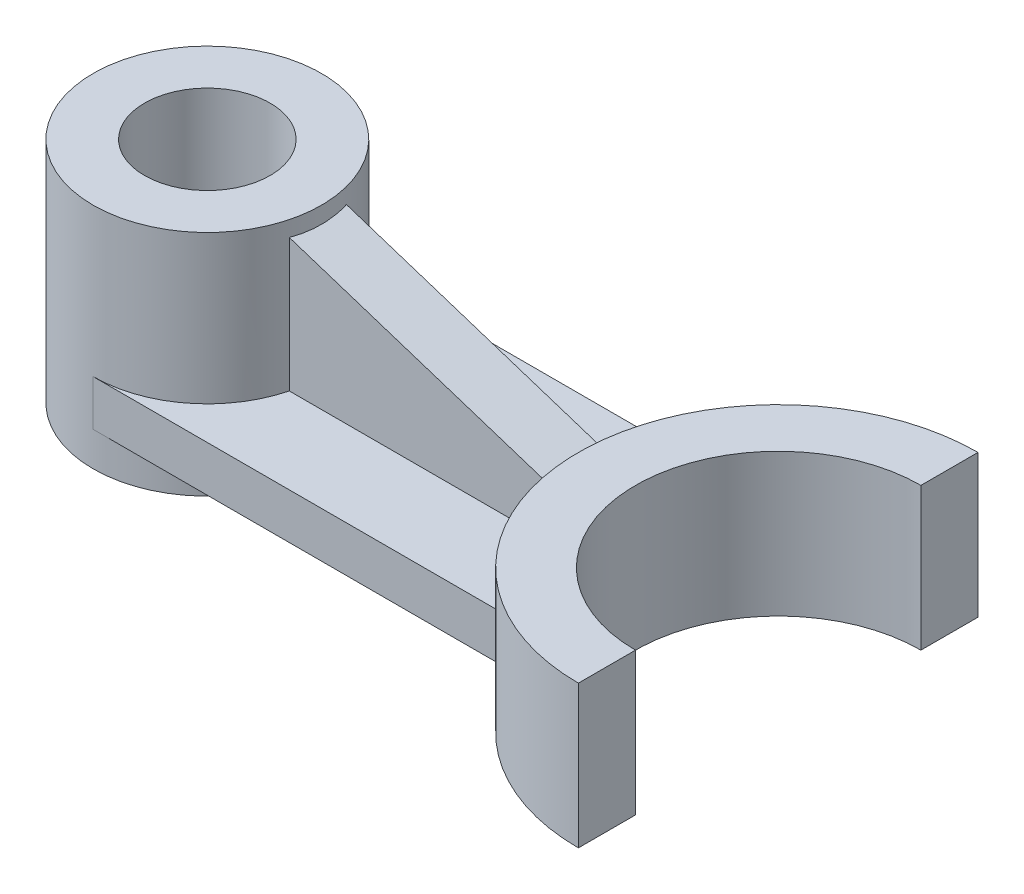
from build123d import *

# Parameters (mm, degrees)
SKETCH_1_R      = 20
SKETCH_1_R_2    = 11
EXTRUDE_1_DEPTH = 40
EXTRUDE_2_DEPTH = 25
EXTRUDE_3_DEPTH = 4
RIB_1_REACH     = 115.248
SKETCH_3_WALL_W = 276.324589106
SKETCH_3_WALL_H = 10


with BuildPart() as part:
    # Sketch 1 → Extrude 1 (new body)
    with BuildSketch(Plane(origin=(0, 0, 0), x_dir=(1, 0, 0), z_dir=(0, 1, 0))):
        with Locations(Location((0, 0, 0), (0, 0, 270))):
            Circle(SKETCH_1_R)
        with Locations(Location((0, 0, 0), (0, 0, 270))):
            Circle(SKETCH_1_R_2, mode=Mode.SUBTRACT)
    extrude(amount=EXTRUDE_1_DEPTH)



with BuildPart() as body_2:
    # Sketch 1_3 → Extrude 2 (new body)
    with BuildSketch(Plane(origin=(0, 0, 0), x_dir=(1, 0, 0), z_dir=(0, 1, 0))):
        with BuildLine():
            Line((100, 35), (100, 25))
            ThreePointArc((100, 25), (75, 0), (100, -25))
            Line((100, -25), (100, -35))
            ThreePointArc((100, -35), (65, 0), (100, 35))
        make_face()
    extrude(amount=EXTRUDE_2_DEPTH)


with BuildPart() as part_1:
    add(part.part)

    add(body_2.part)  # Extrude 3 merges body 2
    # Sketch 2 → Extrude 3 (add, symmetric)
    with BuildSketch(Plane(origin=(0, 10, 0), x_dir=(-1, 0, 0), z_dir=(0, 1, 0))):
        with BuildLine():
            Line((0, 20), (-71.277186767, 20))
            ThreePointArc((-71.277186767, 20), (-65, 0), (-71.277186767, -20))
            Line((-71.277186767, -20), (0, -20))
            ThreePointArc((0, -20), (-20, 0), (0, 20))
        make_face()
    extrude(amount=EXTRUDE_3_DEPTH, both=True)

    # Sketch 3 wall → Rib 1 (add, up to next)
    with BuildSketch(Plane(origin=(42.250957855, 29.865900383, 0), x_dir=(-0.951254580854, 0.308406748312, 0), z_dir=(-0.308406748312, -0.951254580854, 0)), mode=Mode.PRIVATE) as rib_1_sk1:
        Rectangle(SKETCH_3_WALL_W, SKETCH_3_WALL_H)
    rib_1_tool1 = extrude(rib_1_sk1.sketch, amount=RIB_1_REACH, mode=Mode.PRIVATE) - part_1.part
    add(rib_1_tool1.solids().sort_by_distance((42.250957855, 29.865900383, 0))[0])


solid = part_1.part
